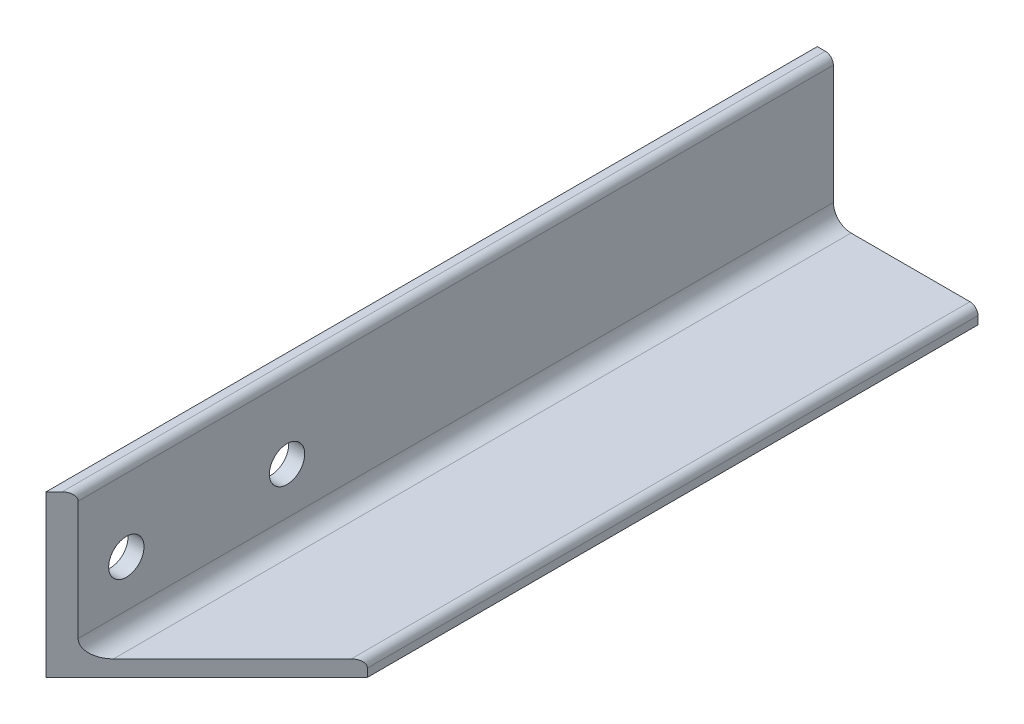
from build123d import *

# Parameters (mm, degrees)
EXTRUDE_1_DEPTH     = 240
CUT_EXTRUDE_1_DEPTH = 240
SKETCH_3_R          = 5.5
CUT_EXTRUDE_2_DEPTH = 240


with BuildPart() as part:
    # Sketch 1 → Extrude 1 (new body)
    with BuildSketch(Plane.XY):
        with BuildLine():
            Line((0, 50), (0, 0))
            Line((0, 0), (50, 0))
            Line((50, 0), (50, 2.5))
            ThreePointArc((50, 2.5), (49.267766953, 4.267766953), (47.5, 5))
            Line((47.5, 5), (10.5, 5))
            ThreePointArc((10.5, 5), (6.610912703, 6.610912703), (5, 10.5))
            Line((5, 10.5), (5, 47.5))
            ThreePointArc((5, 47.5), (4.267766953, 49.267766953), (2.5, 50))
            Line((2.5, 50), (0, 50))
        make_face()
    extrude(amount=EXTRUDE_1_DEPTH)

    # Sketch 2 → Cut-Extrude 1 (cut)
    with BuildSketch(Plane.XZ):
        Polygon((50, 240), (50, 190), (0, 240), align=None)
    extrude(amount=-CUT_EXTRUDE_1_DEPTH, mode=Mode.SUBTRACT)

    # Sketch 3 → Cut-Extrude 2 (cut)
    with BuildSketch(Plane.ZY):
        with Locations(Location((220, 25, 0), (0, 0, 270))):
            Circle(SKETCH_3_R)
        with Locations(Location((170, 25, 0), (0, 0, 270))):
            Circle(SKETCH_3_R)
    extrude(amount=-CUT_EXTRUDE_2_DEPTH, mode=Mode.SUBTRACT)


solid = part.part
